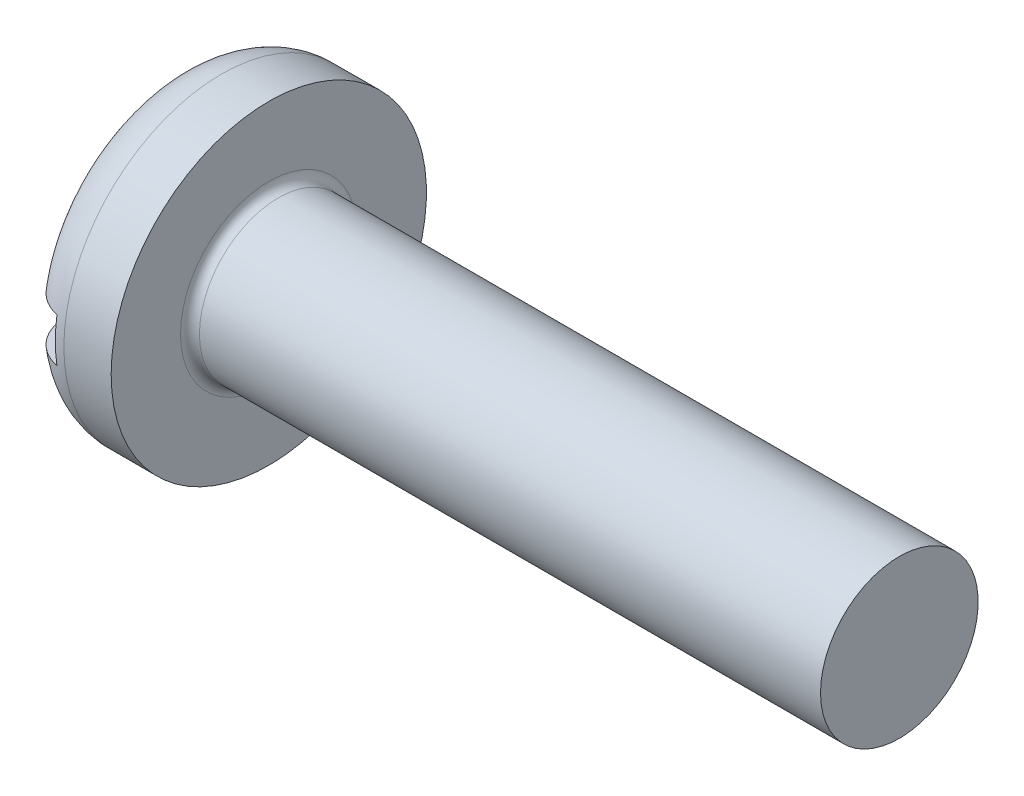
from build123d import *

# Parameters (mm, degrees)
FILLET_HEAD_R = 3
FILLET2_R     = 0.6
SLOTSKE_W     = 20
SLOTSKE_H     = 2.81
SLOT_DEPTH    = 2.4


with BuildPart() as part:
    # BodySke → BaseBody (revolve)
    with BuildSketch(Plane.XY, mode=Mode.PRIVATE) as basebody_sk:
        Polygon((0, 0), (0, 10), (6, 10), (6, 5), (46, 5), (46, 0), align=None)
    revolve(basebody_sk.sketch.rotate(Axis((0, 0, 0), (1, 0, 0)), 90), axis=Axis((0, 0, 0), (1, 0, 0)))

    # Fillet_head
    fillet_head_edges = [part.edges().sort_by_distance(p)[0] for p in [
        (0, 0, -10),
    ]]
    fillet(fillet_head_edges, radius=FILLET_HEAD_R)

    # Fillet2
    fillet2_edges = [part.edges().sort_by_distance(p)[0] for p in [
        (6, 0, -5),
    ]]
    fillet(fillet2_edges, radius=FILLET2_R)

    # SlotSke → Slot (cut)
    with BuildSketch(Plane.ZY):
        Rectangle(SLOTSKE_W, SLOTSKE_H)
    extrude(amount=-SLOT_DEPTH, mode=Mode.SUBTRACT)


solid = part.part
